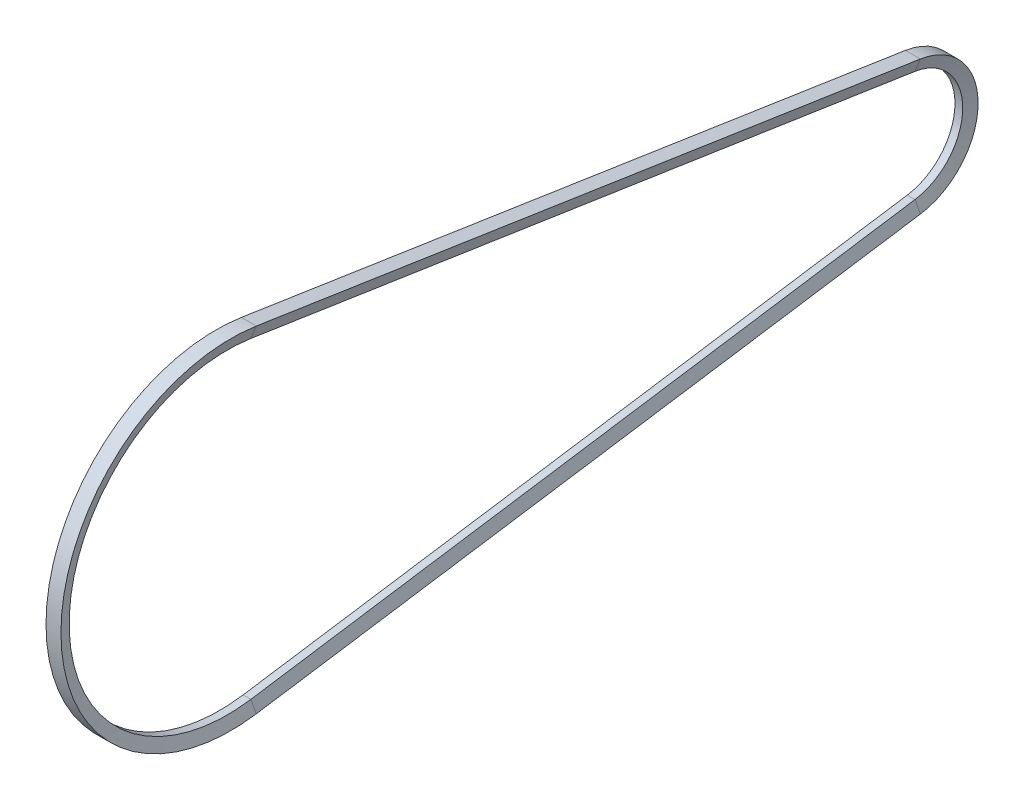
ISO-10303-21;
HEADER;
FILE_DESCRIPTION(('STEP AP214'),'2;1');
FILE_NAME('part.step','',(''),(''),'','','');
FILE_SCHEMA(('AUTOMOTIVE_DESIGN { 1 0 10303 214 1 1 1 1 }'));
ENDSEC;
DATA;
#1=APPLICATION_CONTEXT('core data for automotive mechanical design processes');
#2=APPLICATION_PROTOCOL_DEFINITION('international standard','automotive_design',2000,#1);
#3=PRODUCT_CONTEXT('',#1,'mechanical');
#4=PRODUCT('Part','Part','',(#3));
#5=PRODUCT_RELATED_PRODUCT_CATEGORY('part','',(#4));
#6=PRODUCT_DEFINITION_FORMATION('','',#4);
#7=PRODUCT_DEFINITION_CONTEXT('part definition',#1,'design');
#8=PRODUCT_DEFINITION('design','',#6,#7);
#9=PRODUCT_DEFINITION_SHAPE('','',#8);
#10=(LENGTH_UNIT() NAMED_UNIT(*) SI_UNIT(.MILLI.,.METRE.));
#11=(NAMED_UNIT(*) PLANE_ANGLE_UNIT() SI_UNIT($,.RADIAN.));
#12=(NAMED_UNIT(*) SI_UNIT($,.STERADIAN.) SOLID_ANGLE_UNIT());
#13=UNCERTAINTY_MEASURE_WITH_UNIT(LENGTH_MEASURE(1.E-05),#10,'distance_accuracy_value','');
#14=(GEOMETRIC_REPRESENTATION_CONTEXT(3) GLOBAL_UNCERTAINTY_ASSIGNED_CONTEXT((#13)) GLOBAL_UNIT_ASSIGNED_CONTEXT((#10,
#11,#12)) REPRESENTATION_CONTEXT('',''));
#15=CARTESIAN_POINT('',(0.,0.,0.));
#16=DIRECTION('',(0.,0.,1.));
#17=DIRECTION('',(1.,0.,0.));
#18=AXIS2_PLACEMENT_3D('',#15,#16,#17);
#19=CARTESIAN_POINT('',(2.84014307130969,40.8327316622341,-506.194999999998));
#20=DIRECTION('',(0.,-0.988685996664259,0.15));
#21=DIRECTION('',(0.,-0.15,-0.988685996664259));
#22=AXIS2_PLACEMENT_3D('',#19,#20,#21);
#23=PLANE('',#22);
#24=DIRECTION('',(1.,0.,0.));
#25=VECTOR('',#24,1.);
#26=CARTESIAN_POINT('',(2.84014307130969,40.8327316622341,-506.194999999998));
#27=LINE('',#26,#25);
#28=CARTESIAN_POINT('',(-2.84014307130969,40.8327316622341,-506.194999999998));
#29=VERTEX_POINT('',#28);
#30=CARTESIAN_POINT('',(2.84014307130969,40.8327316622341,-506.194999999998));
#31=VERTEX_POINT('',#30);
#32=EDGE_CURVE('E158',#29,#31,#27,.T.);
#33=ORIENTED_EDGE('',*,*,#32,.T.);
#34=DIRECTION('',(0.,0.15,0.988685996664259));
#35=VECTOR('',#34,1.);
#36=CARTESIAN_POINT('',(2.84014307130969,40.8327316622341,-506.194999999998));
#37=LINE('',#36,#35);
#38=CARTESIAN_POINT('',(2.84014307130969,114.984181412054,-17.4449999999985));
#39=VERTEX_POINT('',#38);
#40=EDGE_CURVE('E39',#31,#39,#37,.T.);
#41=ORIENTED_EDGE('',*,*,#40,.T.);
#42=DIRECTION('',(1.,0.,0.));
#43=VECTOR('',#42,1.);
#44=CARTESIAN_POINT('',(2.84014307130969,114.984181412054,-17.4449999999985));
#45=LINE('',#44,#43);
#46=CARTESIAN_POINT('',(-2.84014307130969,114.984181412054,-17.4449999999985));
#47=VERTEX_POINT('',#46);
#48=EDGE_CURVE('E179',#47,#39,#45,.T.);
#49=ORIENTED_EDGE('',*,*,#48,.F.);
#50=DIRECTION('',(0.,0.15,0.988685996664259));
#51=VECTOR('',#50,1.);
#52=CARTESIAN_POINT('',(-2.84014307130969,40.8327316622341,-506.194999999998));
#53=LINE('',#52,#51);
#54=EDGE_CURVE('E11',#29,#47,#53,.T.);
#55=ORIENTED_EDGE('',*,*,#54,.F.);
#56=EDGE_LOOP('',(#33,#41,#49,#55));
#57=FACE_BOUND('',#56,.T.);
#58=ADVANCED_FACE('F31',(#57),#23,.T.);
#59=CARTESIAN_POINT('',(5.5,49.4342998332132,-507.499999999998));
#60=DIRECTION('',(0.956304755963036,-0.289063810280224,0.04385575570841));
#61=DIRECTION('',(0.289342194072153,0.95722572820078,0.));
#62=AXIS2_PLACEMENT_3D('',#59,#60,#61);
#63=PLANE('',#62);
#64=DIRECTION('',(0.292371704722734,0.945485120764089,-0.143445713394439));
#65=VECTOR('',#64,1.);
#66=CARTESIAN_POINT('',(5.5,49.4342998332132,-507.499999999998));
#67=LINE('',#66,#65);
#68=CARTESIAN_POINT('',(5.5,49.4342998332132,-507.499999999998));
#69=VERTEX_POINT('',#68);
#70=EDGE_CURVE('E155',#31,#69,#67,.T.);
#71=ORIENTED_EDGE('',*,*,#70,.T.);
#72=DIRECTION('',(0.,0.15,0.988685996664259));
#73=VECTOR('',#72,1.);
#74=CARTESIAN_POINT('',(5.5,49.4342998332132,-507.499999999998));
#75=LINE('',#74,#73);
#76=CARTESIAN_POINT('',(5.5,123.585749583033,-18.7499999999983));
#77=VERTEX_POINT('',#76);
#78=EDGE_CURVE('E184',#69,#77,#75,.T.);
#79=ORIENTED_EDGE('',*,*,#78,.T.);
#80=DIRECTION('',(0.292371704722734,0.945485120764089,-0.143445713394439));
#81=VECTOR('',#80,1.);
#82=CARTESIAN_POINT('',(5.5,123.585749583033,-18.7499999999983));
#83=LINE('',#82,#81);
#84=EDGE_CURVE('E177',#39,#77,#83,.T.);
#85=ORIENTED_EDGE('',*,*,#84,.F.);
#86=ORIENTED_EDGE('',*,*,#40,.F.);
#87=EDGE_LOOP('',(#71,#79,#85,#86));
#88=FACE_BOUND('',#87,.T.);
#89=ADVANCED_FACE('F208',(#88),#63,.T.);
#90=CARTESIAN_POINT('',(-5.5,49.4342998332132,-507.499999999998));
#91=DIRECTION('',(0.,0.988685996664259,-0.15));
#92=DIRECTION('',(0.,0.15,0.988685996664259));
#93=AXIS2_PLACEMENT_3D('',#90,#91,#92);
#94=PLANE('',#93);
#95=DIRECTION('',(-1.,0.,0.));
#96=VECTOR('',#95,1.);
#97=CARTESIAN_POINT('',(-5.5,49.4342998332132,-507.499999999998));
#98=LINE('',#97,#96);
#99=CARTESIAN_POINT('',(-5.5,49.4342998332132,-507.499999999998));
#100=VERTEX_POINT('',#99);
#101=EDGE_CURVE('E152',#69,#100,#98,.T.);
#102=ORIENTED_EDGE('',*,*,#101,.T.);
#103=DIRECTION('',(0.,0.15,0.988685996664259));
#104=VECTOR('',#103,1.);
#105=CARTESIAN_POINT('',(-5.5,49.4342998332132,-507.499999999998));
#106=LINE('',#105,#104);
#107=CARTESIAN_POINT('',(-5.5,123.585749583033,-18.7499999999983));
#108=VERTEX_POINT('',#107);
#109=EDGE_CURVE('E181',#100,#108,#106,.T.);
#110=ORIENTED_EDGE('',*,*,#109,.T.);
#111=DIRECTION('',(-1.,0.,0.));
#112=VECTOR('',#111,1.);
#113=CARTESIAN_POINT('',(-5.5,123.585749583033,-18.7499999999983));
#114=LINE('',#113,#112);
#115=EDGE_CURVE('E174',#77,#108,#114,.T.);
#116=ORIENTED_EDGE('',*,*,#115,.F.);
#117=ORIENTED_EDGE('',*,*,#78,.F.);
#118=EDGE_LOOP('',(#102,#110,#116,#117));
#119=FACE_BOUND('',#118,.T.);
#120=ADVANCED_FACE('F207',(#119),#94,.T.);
#121=CARTESIAN_POINT('',(-2.84014307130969,40.8327316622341,-506.194999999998));
#122=DIRECTION('',(-0.956304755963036,-0.289063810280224,0.04385575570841));
#123=DIRECTION('',(0.289342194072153,-0.95722572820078,0.));
#124=AXIS2_PLACEMENT_3D('',#121,#122,#123);
#125=PLANE('',#124);
#126=DIRECTION('',(0.292371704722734,-0.945485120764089,0.143445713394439));
#127=VECTOR('',#126,1.);
#128=CARTESIAN_POINT('',(-2.84014307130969,40.8327316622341,-506.194999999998));
#129=LINE('',#128,#127);
#130=EDGE_CURVE('E110',#100,#29,#129,.T.);
#131=ORIENTED_EDGE('',*,*,#130,.T.);
#132=ORIENTED_EDGE('',*,*,#54,.T.);
#133=DIRECTION('',(0.292371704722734,-0.945485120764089,0.143445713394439));
#134=VECTOR('',#133,1.);
#135=CARTESIAN_POINT('',(-2.84014307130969,114.984181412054,-17.4449999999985));
#136=LINE('',#135,#134);
#137=EDGE_CURVE('E123',#108,#47,#136,.T.);
#138=ORIENTED_EDGE('',*,*,#137,.F.);
#139=ORIENTED_EDGE('',*,*,#109,.F.);
#140=EDGE_LOOP('',(#131,#132,#138,#139));
#141=FACE_BOUND('',#140,.T.);
#142=ADVANCED_FACE('F241',(#141),#125,.T.);
#143=CARTESIAN_POINT('',(0.,0.,-500.));
#144=DIRECTION('',(1.,0.,0.));
#145=DIRECTION('',(0.,0.,-1.));
#146=AXIS2_PLACEMENT_3D('',#143,#144,#145);
#147=CYLINDRICAL_SURFACE('',#146,41.2999999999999);
#148=DIRECTION('',(1.,0.,0.));
#149=VECTOR('',#148,1.);
#150=CARTESIAN_POINT('',(2.84014307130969,-40.8327316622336,-506.195000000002));
#151=LINE('',#150,#149);
#152=CARTESIAN_POINT('',(-2.84014307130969,-40.8327316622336,-506.195000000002));
#153=VERTEX_POINT('',#152);
#154=CARTESIAN_POINT('',(2.84014307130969,-40.8327316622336,-506.195000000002));
#155=VERTEX_POINT('',#154);
#156=EDGE_CURVE('E107',#153,#155,#151,.T.);
#157=ORIENTED_EDGE('',*,*,#156,.T.);
#158=CARTESIAN_POINT('',(2.84014307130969,0.,-500.));
#159=DIRECTION('',(1.,0.,0.));
#160=DIRECTION('',(0.,0.,-1.));
#161=AXIS2_PLACEMENT_3D('',#158,#159,#160);
#162=CIRCLE('',#161,41.2999999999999);
#163=EDGE_CURVE('E167',#155,#31,#162,.T.);
#164=ORIENTED_EDGE('',*,*,#163,.T.);
#165=ORIENTED_EDGE('',*,*,#32,.F.);
#166=CARTESIAN_POINT('',(-2.84014307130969,0.,-500.));
#167=DIRECTION('',(1.,0.,0.));
#168=DIRECTION('',(0.,0.,-1.));
#169=AXIS2_PLACEMENT_3D('',#166,#167,#168);
#170=CIRCLE('',#169,41.2999999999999);
#171=EDGE_CURVE('E170',#153,#29,#170,.T.);
#172=ORIENTED_EDGE('',*,*,#171,.F.);
#173=EDGE_LOOP('',(#157,#164,#165,#172));
#174=FACE_BOUND('',#173,.T.);
#175=ADVANCED_FACE('F238',(#174),#147,.F.);
#176=CARTESIAN_POINT('',(2.84014307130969,0.,-500.));
#177=DIRECTION('',(1.,0.,0.));
#178=DIRECTION('',(0.,0.,-1.));
#179=AXIS2_PLACEMENT_3D('',#176,#177,#178);
#180=CONICAL_SURFACE('',#179,41.2999999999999,1.27409035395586);
#181=DIRECTION('',(0.292371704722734,-0.945485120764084,-0.143445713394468));
#182=VECTOR('',#181,1.);
#183=CARTESIAN_POINT('',(5.5,-49.4342998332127,-507.500000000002));
#184=LINE('',#183,#182);
#185=CARTESIAN_POINT('',(5.5,-49.4342998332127,-507.500000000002));
#186=VERTEX_POINT('',#185);
#187=EDGE_CURVE('E141',#155,#186,#184,.T.);
#188=ORIENTED_EDGE('',*,*,#187,.T.);
#189=CARTESIAN_POINT('',(5.5,0.,-500.));
#190=DIRECTION('',(1.,0.,0.));
#191=DIRECTION('',(0.,0.,-1.));
#192=AXIS2_PLACEMENT_3D('',#189,#190,#191);
#193=CIRCLE('',#192,49.9999999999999);
#194=EDGE_CURVE('E164',#186,#69,#193,.T.);
#195=ORIENTED_EDGE('',*,*,#194,.T.);
#196=ORIENTED_EDGE('',*,*,#70,.F.);
#197=ORIENTED_EDGE('',*,*,#163,.F.);
#198=EDGE_LOOP('',(#188,#195,#196,#197));
#199=FACE_BOUND('',#198,.T.);
#200=ADVANCED_FACE('F215',(#199),#180,.F.);
#201=CARTESIAN_POINT('',(0.,0.,-500.));
#202=DIRECTION('',(1.,0.,0.));
#203=DIRECTION('',(0.,0.,-1.));
#204=AXIS2_PLACEMENT_3D('',#201,#202,#203);
#205=CYLINDRICAL_SURFACE('',#204,49.9999999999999);
#206=DIRECTION('',(-1.,0.,0.));
#207=VECTOR('',#206,1.);
#208=CARTESIAN_POINT('',(-5.5,-49.4342998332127,-507.500000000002));
#209=LINE('',#208,#207);
#210=CARTESIAN_POINT('',(-5.5,-49.4342998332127,-507.500000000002));
#211=VERTEX_POINT('',#210);
#212=EDGE_CURVE('E137',#186,#211,#209,.T.);
#213=ORIENTED_EDGE('',*,*,#212,.T.);
#214=CARTESIAN_POINT('',(-5.5,0.,-500.));
#215=DIRECTION('',(1.,0.,0.));
#216=DIRECTION('',(0.,0.,-1.));
#217=AXIS2_PLACEMENT_3D('',#214,#215,#216);
#218=CIRCLE('',#217,49.9999999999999);
#219=EDGE_CURVE('E161',#211,#100,#218,.T.);
#220=ORIENTED_EDGE('',*,*,#219,.T.);
#221=ORIENTED_EDGE('',*,*,#101,.F.);
#222=ORIENTED_EDGE('',*,*,#194,.F.);
#223=EDGE_LOOP('',(#213,#220,#221,#222));
#224=FACE_BOUND('',#223,.T.);
#225=ADVANCED_FACE('F213',(#224),#205,.T.);
#226=CARTESIAN_POINT('',(-5.5,0.,-500.));
#227=DIRECTION('',(-1.,0.,0.));
#228=DIRECTION('',(0.,0.,1.));
#229=AXIS2_PLACEMENT_3D('',#226,#227,#228);
#230=CONICAL_SURFACE('',#229,49.9999999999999,1.27409035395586);
#231=DIRECTION('',(0.292371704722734,0.945485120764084,0.143445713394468));
#232=VECTOR('',#231,1.);
#233=CARTESIAN_POINT('',(-2.84014307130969,-40.8327316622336,-506.195000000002));
#234=LINE('',#233,#232);
#235=EDGE_CURVE('E134',#211,#153,#234,.T.);
#236=ORIENTED_EDGE('',*,*,#235,.T.);
#237=ORIENTED_EDGE('',*,*,#171,.T.);
#238=ORIENTED_EDGE('',*,*,#130,.F.);
#239=ORIENTED_EDGE('',*,*,#219,.F.);
#240=EDGE_LOOP('',(#236,#237,#238,#239));
#241=FACE_BOUND('',#240,.T.);
#242=ADVANCED_FACE('F229',(#241),#230,.F.);
#243=CARTESIAN_POINT('',(2.84014307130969,-114.984181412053,-17.4450000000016));
#244=DIRECTION('',(0.,0.988685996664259,0.15));
#245=DIRECTION('',(0.,-0.15,0.988685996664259));
#246=AXIS2_PLACEMENT_3D('',#243,#244,#245);
#247=PLANE('',#246);
#248=DIRECTION('',(1.,0.,0.));
#249=VECTOR('',#248,1.);
#250=CARTESIAN_POINT('',(2.84014307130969,-114.984181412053,-17.4450000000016));
#251=LINE('',#250,#249);
#252=CARTESIAN_POINT('',(-2.84014307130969,-114.984181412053,-17.4450000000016));
#253=VERTEX_POINT('',#252);
#254=CARTESIAN_POINT('',(2.84014307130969,-114.984181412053,-17.4450000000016));
#255=VERTEX_POINT('',#254);
#256=EDGE_CURVE('E105',#253,#255,#251,.T.);
#257=ORIENTED_EDGE('',*,*,#256,.T.);
#258=DIRECTION('',(0.,0.15,-0.988685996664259));
#259=VECTOR('',#258,1.);
#260=CARTESIAN_POINT('',(2.84014307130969,-114.984181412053,-17.4450000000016));
#261=LINE('',#260,#259);
#262=EDGE_CURVE('E111',#255,#155,#261,.T.);
#263=ORIENTED_EDGE('',*,*,#262,.T.);
#264=ORIENTED_EDGE('',*,*,#156,.F.);
#265=DIRECTION('',(0.,0.15,-0.988685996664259));
#266=VECTOR('',#265,1.);
#267=CARTESIAN_POINT('',(-2.84014307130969,-114.984181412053,-17.4450000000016));
#268=LINE('',#267,#266);
#269=EDGE_CURVE('E101',#253,#153,#268,.T.);
#270=ORIENTED_EDGE('',*,*,#269,.F.);
#271=EDGE_LOOP('',(#257,#263,#264,#270));
#272=FACE_BOUND('',#271,.T.);
#273=ADVANCED_FACE('F103',(#272),#247,.T.);
#274=CARTESIAN_POINT('',(5.5,-123.585749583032,-18.7500000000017));
#275=DIRECTION('',(0.956304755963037,0.289063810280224,0.04385575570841));
#276=DIRECTION('',(-0.289342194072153,0.957225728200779,0.));
#277=AXIS2_PLACEMENT_3D('',#274,#275,#276);
#278=PLANE('',#277);
#279=DIRECTION('',(0.292371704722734,-0.945485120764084,-0.143445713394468));
#280=VECTOR('',#279,1.);
#281=CARTESIAN_POINT('',(5.5,-123.585749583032,-18.7500000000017));
#282=LINE('',#281,#280);
#283=CARTESIAN_POINT('',(5.5,-123.585749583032,-18.7500000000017));
#284=VERTEX_POINT('',#283);
#285=EDGE_CURVE('E128',#255,#284,#282,.T.);
#286=ORIENTED_EDGE('',*,*,#285,.T.);
#287=DIRECTION('',(0.,0.15,-0.988685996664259));
#288=VECTOR('',#287,1.);
#289=CARTESIAN_POINT('',(5.5,-123.585749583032,-18.7500000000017));
#290=LINE('',#289,#288);
#291=EDGE_CURVE('E146',#284,#186,#290,.T.);
#292=ORIENTED_EDGE('',*,*,#291,.T.);
#293=ORIENTED_EDGE('',*,*,#187,.F.);
#294=ORIENTED_EDGE('',*,*,#262,.F.);
#295=EDGE_LOOP('',(#286,#292,#293,#294));
#296=FACE_BOUND('',#295,.T.);
#297=ADVANCED_FACE('F221',(#296),#278,.T.);
#298=CARTESIAN_POINT('',(-5.5,-123.585749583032,-18.7500000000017));
#299=DIRECTION('',(0.,-0.988685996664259,-0.15));
#300=DIRECTION('',(0.,0.15,-0.988685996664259));
#301=AXIS2_PLACEMENT_3D('',#298,#299,#300);
#302=PLANE('',#301);
#303=DIRECTION('',(-1.,0.,0.));
#304=VECTOR('',#303,1.);
#305=CARTESIAN_POINT('',(-5.5,-123.585749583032,-18.7500000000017));
#306=LINE('',#305,#304);
#307=CARTESIAN_POINT('',(-5.5,-123.585749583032,-18.7500000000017));
#308=VERTEX_POINT('',#307);
#309=EDGE_CURVE('E125',#284,#308,#306,.T.);
#310=ORIENTED_EDGE('',*,*,#309,.T.);
#311=DIRECTION('',(0.,0.15,-0.988685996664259));
#312=VECTOR('',#311,1.);
#313=CARTESIAN_POINT('',(-5.5,-123.585749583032,-18.7500000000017));
#314=LINE('',#313,#312);
#315=EDGE_CURVE('E117',#308,#211,#314,.T.);
#316=ORIENTED_EDGE('',*,*,#315,.T.);
#317=ORIENTED_EDGE('',*,*,#212,.F.);
#318=ORIENTED_EDGE('',*,*,#291,.F.);
#319=EDGE_LOOP('',(#310,#316,#317,#318));
#320=FACE_BOUND('',#319,.T.);
#321=ADVANCED_FACE('F220',(#320),#302,.T.);
#322=CARTESIAN_POINT('',(-2.84014307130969,-114.984181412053,-17.4450000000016));
#323=DIRECTION('',(-0.956304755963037,0.289063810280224,0.04385575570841));
#324=DIRECTION('',(-0.289342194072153,-0.957225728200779,0.));
#325=AXIS2_PLACEMENT_3D('',#322,#323,#324);
#326=PLANE('',#325);
#327=DIRECTION('',(0.292371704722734,0.945485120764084,0.143445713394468));
#328=VECTOR('',#327,1.);
#329=CARTESIAN_POINT('',(-2.84014307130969,-114.984181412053,-17.4450000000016));
#330=LINE('',#329,#328);
#331=EDGE_CURVE('E114',#308,#253,#330,.T.);
#332=ORIENTED_EDGE('',*,*,#331,.T.);
#333=ORIENTED_EDGE('',*,*,#269,.T.);
#334=ORIENTED_EDGE('',*,*,#235,.F.);
#335=ORIENTED_EDGE('',*,*,#315,.F.);
#336=EDGE_LOOP('',(#332,#333,#334,#335));
#337=FACE_BOUND('',#336,.T.);
#338=ADVANCED_FACE('F115',(#337),#326,.T.);
#339=CARTESIAN_POINT('',(-5.5,0.,0.));
#340=DIRECTION('',(-1.,0.,0.));
#341=DIRECTION('',(0.,0.,1.));
#342=AXIS2_PLACEMENT_3D('',#339,#340,#341);
#343=CONICAL_SURFACE('',#342,125.,1.27409035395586);
#344=CARTESIAN_POINT('',(-5.5,0.,0.));
#345=DIRECTION('',(-1.,0.,0.));
#346=DIRECTION('',(0.,0.,1.));
#347=AXIS2_PLACEMENT_3D('',#344,#345,#346);
#348=CIRCLE('',#347,125.);
#349=EDGE_CURVE('E138',#308,#108,#348,.T.);
#350=ORIENTED_EDGE('',*,*,#349,.T.);
#351=ORIENTED_EDGE('',*,*,#137,.T.);
#352=CARTESIAN_POINT('',(-2.84014307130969,0.,0.));
#353=DIRECTION('',(-1.,0.,0.));
#354=DIRECTION('',(0.,0.,1.));
#355=AXIS2_PLACEMENT_3D('',#352,#353,#354);
#356=CIRCLE('',#355,116.3);
#357=EDGE_CURVE('E47',#253,#47,#356,.T.);
#358=ORIENTED_EDGE('',*,*,#357,.F.);
#359=ORIENTED_EDGE('',*,*,#331,.F.);
#360=EDGE_LOOP('',(#350,#351,#358,#359));
#361=FACE_BOUND('',#360,.T.);
#362=ADVANCED_FACE('F121',(#361),#343,.F.);
#363=CARTESIAN_POINT('',(0.,0.,0.));
#364=DIRECTION('',(-1.,0.,0.));
#365=DIRECTION('',(0.,0.,1.));
#366=AXIS2_PLACEMENT_3D('',#363,#364,#365);
#367=CYLINDRICAL_SURFACE('',#366,125.);
#368=CARTESIAN_POINT('',(5.5,0.,0.));
#369=DIRECTION('',(-1.,0.,0.));
#370=DIRECTION('',(0.,0.,1.));
#371=AXIS2_PLACEMENT_3D('',#368,#369,#370);
#372=CIRCLE('',#371,125.);
#373=EDGE_CURVE('E192',#284,#77,#372,.T.);
#374=ORIENTED_EDGE('',*,*,#373,.T.);
#375=ORIENTED_EDGE('',*,*,#115,.T.);
#376=ORIENTED_EDGE('',*,*,#349,.F.);
#377=ORIENTED_EDGE('',*,*,#309,.F.);
#378=EDGE_LOOP('',(#374,#375,#376,#377));
#379=FACE_BOUND('',#378,.T.);
#380=ADVANCED_FACE('F200',(#379),#367,.T.);
#381=CARTESIAN_POINT('',(2.84014307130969,0.,0.));
#382=DIRECTION('',(1.,0.,0.));
#383=DIRECTION('',(0.,0.,-1.));
#384=AXIS2_PLACEMENT_3D('',#381,#382,#383);
#385=CONICAL_SURFACE('',#384,116.3,1.27409035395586);
#386=CARTESIAN_POINT('',(2.84014307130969,0.,0.));
#387=DIRECTION('',(-1.,0.,0.));
#388=DIRECTION('',(0.,0.,1.));
#389=AXIS2_PLACEMENT_3D('',#386,#387,#388);
#390=CIRCLE('',#389,116.3);
#391=EDGE_CURVE('E55',#255,#39,#390,.T.);
#392=ORIENTED_EDGE('',*,*,#391,.T.);
#393=ORIENTED_EDGE('',*,*,#84,.T.);
#394=ORIENTED_EDGE('',*,*,#373,.F.);
#395=ORIENTED_EDGE('',*,*,#285,.F.);
#396=EDGE_LOOP('',(#392,#393,#394,#395));
#397=FACE_BOUND('',#396,.T.);
#398=ADVANCED_FACE('F204',(#397),#385,.F.);
#399=CARTESIAN_POINT('',(0.,0.,0.));
#400=DIRECTION('',(-1.,0.,0.));
#401=DIRECTION('',(0.,0.,1.));
#402=AXIS2_PLACEMENT_3D('',#399,#400,#401);
#403=CYLINDRICAL_SURFACE('',#402,116.3);
#404=ORIENTED_EDGE('',*,*,#256,.F.);
#405=ORIENTED_EDGE('',*,*,#357,.T.);
#406=ORIENTED_EDGE('',*,*,#48,.T.);
#407=ORIENTED_EDGE('',*,*,#391,.F.);
#408=EDGE_LOOP('',(#404,#405,#406,#407));
#409=FACE_BOUND('',#408,.T.);
#410=ADVANCED_FACE('F127',(#409),#403,.F.);
#411=CLOSED_SHELL('',(#58,#89,#120,#142,#175,#200,#225,#242,#273,#297,#321,#338,#362,#380,#398,#410));
#412=MANIFOLD_SOLID_BREP('B2',#411);
#413=ADVANCED_BREP_SHAPE_REPRESENTATION('',(#18,#412),#14);
#414=SHAPE_DEFINITION_REPRESENTATION(#9,#413);
ENDSEC;
END-ISO-10303-21;
